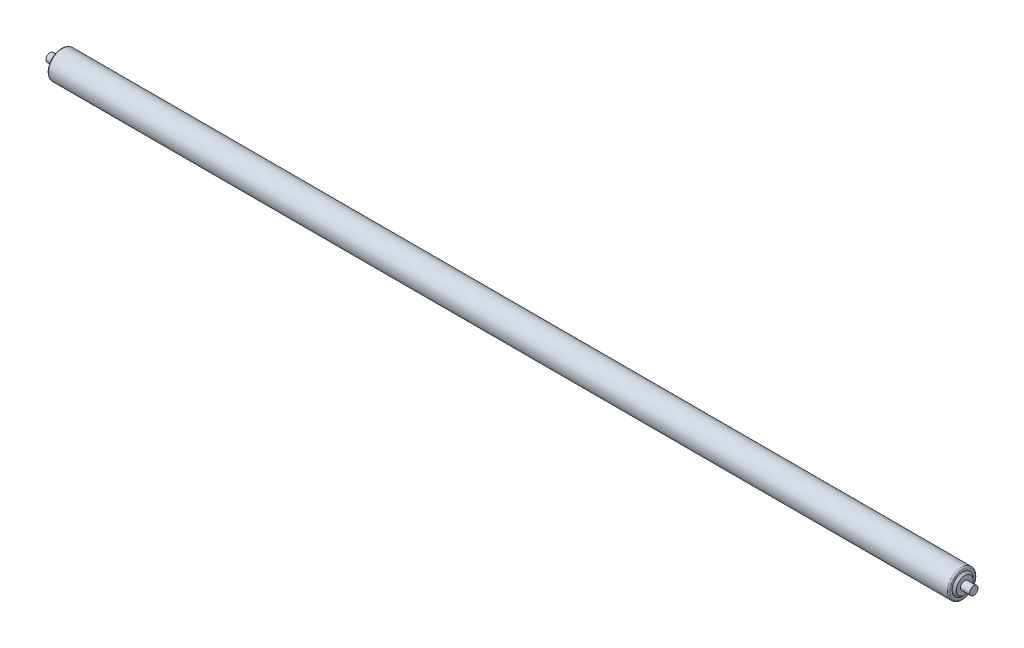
ISO-10303-21;
HEADER;
FILE_DESCRIPTION(('STEP AP214'),'2;1');
FILE_NAME('part.step','',(''),(''),'','','');
FILE_SCHEMA(('AUTOMOTIVE_DESIGN { 1 0 10303 214 1 1 1 1 }'));
ENDSEC;
DATA;
#1=APPLICATION_CONTEXT('core data for automotive mechanical design processes');
#2=APPLICATION_PROTOCOL_DEFINITION('international standard','automotive_design',2000,#1);
#3=PRODUCT_CONTEXT('',#1,'mechanical');
#4=PRODUCT('Part','Part','',(#3));
#5=PRODUCT_RELATED_PRODUCT_CATEGORY('part','',(#4));
#6=PRODUCT_DEFINITION_FORMATION('','',#4);
#7=PRODUCT_DEFINITION_CONTEXT('part definition',#1,'design');
#8=PRODUCT_DEFINITION('design','',#6,#7);
#9=PRODUCT_DEFINITION_SHAPE('','',#8);
#10=(LENGTH_UNIT() NAMED_UNIT(*) SI_UNIT(.MILLI.,.METRE.));
#11=(NAMED_UNIT(*) PLANE_ANGLE_UNIT() SI_UNIT($,.RADIAN.));
#12=(NAMED_UNIT(*) SI_UNIT($,.STERADIAN.) SOLID_ANGLE_UNIT());
#13=UNCERTAINTY_MEASURE_WITH_UNIT(LENGTH_MEASURE(1.E-05),#10,'distance_accuracy_value','');
#14=(GEOMETRIC_REPRESENTATION_CONTEXT(3) GLOBAL_UNCERTAINTY_ASSIGNED_CONTEXT((#13)) GLOBAL_UNIT_ASSIGNED_CONTEXT((#10,
#11,#12)) REPRESENTATION_CONTEXT('',''));
#15=CARTESIAN_POINT('',(0.,0.,0.));
#16=DIRECTION('',(0.,0.,1.));
#17=DIRECTION('',(1.,0.,0.));
#18=AXIS2_PLACEMENT_3D('',#15,#16,#17);
#19=CARTESIAN_POINT('',(324.,6.,0.));
#20=DIRECTION('',(1.,0.,0.));
#21=DIRECTION('',(0.,0.,-1.));
#22=AXIS2_PLACEMENT_3D('',#19,#20,#21);
#23=PLANE('',#22);
#24=CARTESIAN_POINT('',(324.,0.,0.));
#25=DIRECTION('',(1.,0.,0.));
#26=DIRECTION('',(0.,0.,-1.));
#27=AXIS2_PLACEMENT_3D('',#24,#25,#26);
#28=CIRCLE('',#27,6.00000000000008);
#29=CARTESIAN_POINT('',(324.,0.,-6.00000000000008));
#30=VERTEX_POINT('',#29);
#31=EDGE_CURVE('E90',#30,#30,#28,.T.);
#32=ORIENTED_EDGE('',*,*,#31,.T.);
#33=EDGE_LOOP('',(#32));
#34=FACE_BOUND('',#33,.T.);
#35=CARTESIAN_POINT('',(324.,0.,0.));
#36=DIRECTION('',(1.,0.,0.));
#37=DIRECTION('',(0.,0.,-1.));
#38=AXIS2_PLACEMENT_3D('',#35,#36,#37);
#39=CIRCLE('',#38,3.);
#40=CARTESIAN_POINT('',(324.,0.,-3.));
#41=VERTEX_POINT('',#40);
#42=EDGE_CURVE('E10',#41,#41,#39,.T.);
#43=ORIENTED_EDGE('',*,*,#42,.F.);
#44=EDGE_LOOP('',(#43));
#45=FACE_BOUND('',#44,.T.);
#46=ADVANCED_FACE('F38',(#34,#45),#23,.T.);
#47=CARTESIAN_POINT('',(330.5,0.,0.));
#48=DIRECTION('',(1.,0.,0.));
#49=DIRECTION('',(0.,0.,-1.));
#50=AXIS2_PLACEMENT_3D('',#47,#48,#49);
#51=CYLINDRICAL_SURFACE('',#50,3.);
#52=ORIENTED_EDGE('',*,*,#42,.T.);
#53=EDGE_LOOP('',(#52));
#54=FACE_BOUND('',#53,.T.);
#55=CARTESIAN_POINT('',(330.5,0.,0.));
#56=DIRECTION('',(1.,0.,0.));
#57=DIRECTION('',(0.,0.,-1.));
#58=AXIS2_PLACEMENT_3D('',#55,#56,#57);
#59=CIRCLE('',#58,3.);
#60=CARTESIAN_POINT('',(330.5,0.,-3.));
#61=VERTEX_POINT('',#60);
#62=EDGE_CURVE('E45',#61,#61,#59,.T.);
#63=ORIENTED_EDGE('',*,*,#62,.F.);
#64=EDGE_LOOP('',(#63));
#65=FACE_BOUND('',#64,.T.);
#66=ADVANCED_FACE('F108',(#54,#65),#51,.T.);
#67=CARTESIAN_POINT('',(330.5,0.,0.));
#68=DIRECTION('',(1.,0.,0.));
#69=DIRECTION('',(0.,0.,-1.));
#70=AXIS2_PLACEMENT_3D('',#67,#68,#69);
#71=PLANE('',#70);
#72=ORIENTED_EDGE('',*,*,#62,.T.);
#73=EDGE_LOOP('',(#72));
#74=FACE_BOUND('',#73,.T.);
#75=ADVANCED_FACE('F112',(#74),#71,.T.);
#76=CARTESIAN_POINT('',(-330.5,0.,0.));
#77=DIRECTION('',(-1.,0.,0.));
#78=DIRECTION('',(0.,0.,1.));
#79=AXIS2_PLACEMENT_3D('',#76,#77,#78);
#80=PLANE('',#79);
#81=CARTESIAN_POINT('',(-330.5,0.,0.));
#82=DIRECTION('',(1.,0.,0.));
#83=DIRECTION('',(0.,0.,-1.));
#84=AXIS2_PLACEMENT_3D('',#81,#82,#83);
#85=CIRCLE('',#84,3.);
#86=CARTESIAN_POINT('',(-330.5,0.,-3.));
#87=VERTEX_POINT('',#86);
#88=EDGE_CURVE('E52',#87,#87,#85,.T.);
#89=ORIENTED_EDGE('',*,*,#88,.F.);
#90=EDGE_LOOP('',(#89));
#91=FACE_BOUND('',#90,.T.);
#92=ADVANCED_FACE('F116',(#91),#80,.T.);
#93=CARTESIAN_POINT('',(330.5,0.,0.));
#94=DIRECTION('',(1.,0.,0.));
#95=DIRECTION('',(0.,0.,-1.));
#96=AXIS2_PLACEMENT_3D('',#93,#94,#95);
#97=CYLINDRICAL_SURFACE('',#96,3.);
#98=ORIENTED_EDGE('',*,*,#88,.T.);
#99=EDGE_LOOP('',(#98));
#100=FACE_BOUND('',#99,.T.);
#101=CARTESIAN_POINT('',(-325.,0.,0.));
#102=DIRECTION('',(1.,0.,0.));
#103=DIRECTION('',(0.,0.,-1.));
#104=AXIS2_PLACEMENT_3D('',#101,#102,#103);
#105=CIRCLE('',#104,3.);
#106=CARTESIAN_POINT('',(-325.,0.,-3.));
#107=VERTEX_POINT('',#106);
#108=EDGE_CURVE('E58',#107,#107,#105,.T.);
#109=ORIENTED_EDGE('',*,*,#108,.F.);
#110=EDGE_LOOP('',(#109));
#111=FACE_BOUND('',#110,.T.);
#112=ADVANCED_FACE('F122',(#100,#111),#97,.T.);
#113=CARTESIAN_POINT('',(-325.,6.,0.));
#114=DIRECTION('',(-1.,0.,0.));
#115=DIRECTION('',(0.,0.,1.));
#116=AXIS2_PLACEMENT_3D('',#113,#114,#115);
#117=PLANE('',#116);
#118=ORIENTED_EDGE('',*,*,#108,.T.);
#119=EDGE_LOOP('',(#118));
#120=FACE_BOUND('',#119,.T.);
#121=CARTESIAN_POINT('',(-325.,0.,0.));
#122=DIRECTION('',(1.,0.,0.));
#123=DIRECTION('',(0.,0.,-1.));
#124=AXIS2_PLACEMENT_3D('',#121,#122,#123);
#125=CIRCLE('',#124,6.00000000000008);
#126=CARTESIAN_POINT('',(-325.,0.,-6.00000000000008));
#127=VERTEX_POINT('',#126);
#128=EDGE_CURVE('E64',#127,#127,#125,.T.);
#129=ORIENTED_EDGE('',*,*,#128,.F.);
#130=EDGE_LOOP('',(#129));
#131=FACE_BOUND('',#130,.T.);
#132=ADVANCED_FACE('F126',(#120,#131),#117,.T.);
#133=CARTESIAN_POINT('',(-322.5,0.,0.));
#134=DIRECTION('',(1.,0.,0.));
#135=DIRECTION('',(0.,0.,-1.));
#136=AXIS2_PLACEMENT_3D('',#133,#134,#135);
#137=CONICAL_SURFACE('',#136,7.50000000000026,0.540419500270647);
#138=ORIENTED_EDGE('',*,*,#128,.T.);
#139=EDGE_LOOP('',(#138));
#140=FACE_BOUND('',#139,.T.);
#141=CARTESIAN_POINT('',(-322.5,0.,0.));
#142=DIRECTION('',(1.,0.,0.));
#143=DIRECTION('',(0.,0.,-1.));
#144=AXIS2_PLACEMENT_3D('',#141,#142,#143);
#145=CIRCLE('',#144,7.50000000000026);
#146=CARTESIAN_POINT('',(-322.5,0.,-7.50000000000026));
#147=VERTEX_POINT('',#146);
#148=EDGE_CURVE('E68',#147,#147,#145,.T.);
#149=ORIENTED_EDGE('',*,*,#148,.F.);
#150=EDGE_LOOP('',(#149));
#151=FACE_BOUND('',#150,.T.);
#152=ADVANCED_FACE('F130',(#140,#151),#137,.T.);
#153=CARTESIAN_POINT('',(-322.5,7.50000000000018,0.));
#154=DIRECTION('',(-1.,0.,0.));
#155=DIRECTION('',(0.,0.,1.));
#156=AXIS2_PLACEMENT_3D('',#153,#154,#155);
#157=PLANE('',#156);
#158=ORIENTED_EDGE('',*,*,#148,.T.);
#159=EDGE_LOOP('',(#158));
#160=FACE_BOUND('',#159,.T.);
#161=CARTESIAN_POINT('',(-322.5,0.,0.));
#162=DIRECTION('',(1.,0.,0.));
#163=DIRECTION('',(0.,0.,-1.));
#164=AXIS2_PLACEMENT_3D('',#161,#162,#163);
#165=CIRCLE('',#164,8.99999999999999);
#166=CARTESIAN_POINT('',(-322.5,0.,-8.99999999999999));
#167=VERTEX_POINT('',#166);
#168=EDGE_CURVE('E71',#167,#167,#165,.T.);
#169=ORIENTED_EDGE('',*,*,#168,.F.);
#170=EDGE_LOOP('',(#169));
#171=FACE_BOUND('',#170,.T.);
#172=ADVANCED_FACE('F134',(#160,#171),#157,.T.);
#173=CARTESIAN_POINT('',(-321.5,0.,0.));
#174=DIRECTION('',(1.,0.,0.));
#175=DIRECTION('',(0.,0.,-1.));
#176=AXIS2_PLACEMENT_3D('',#173,#174,#175);
#177=TOROIDAL_SURFACE('',#176,9.,1.);
#178=ORIENTED_EDGE('',*,*,#168,.T.);
#179=EDGE_LOOP('',(#178));
#180=FACE_BOUND('',#179,.T.);
#181=CARTESIAN_POINT('',(-321.5,0.,0.));
#182=DIRECTION('',(1.,0.,0.));
#183=DIRECTION('',(0.,0.,-1.));
#184=AXIS2_PLACEMENT_3D('',#181,#182,#183);
#185=CIRCLE('',#184,10.);
#186=CARTESIAN_POINT('',(-321.5,0.,-10.));
#187=VERTEX_POINT('',#186);
#188=EDGE_CURVE('E75',#187,#187,#185,.T.);
#189=ORIENTED_EDGE('',*,*,#188,.F.);
#190=EDGE_LOOP('',(#189));
#191=FACE_BOUND('',#190,.T.);
#192=ADVANCED_FACE('F138',(#180,#191),#177,.T.);
#193=CARTESIAN_POINT('',(330.5,0.,0.));
#194=DIRECTION('',(1.,0.,0.));
#195=DIRECTION('',(0.,0.,-1.));
#196=AXIS2_PLACEMENT_3D('',#193,#194,#195);
#197=CYLINDRICAL_SURFACE('',#196,10.);
#198=ORIENTED_EDGE('',*,*,#188,.T.);
#199=EDGE_LOOP('',(#198));
#200=FACE_BOUND('',#199,.T.);
#201=CARTESIAN_POINT('',(321.5,0.,0.));
#202=DIRECTION('',(1.,0.,0.));
#203=DIRECTION('',(0.,0.,-1.));
#204=AXIS2_PLACEMENT_3D('',#201,#202,#203);
#205=CIRCLE('',#204,10.);
#206=CARTESIAN_POINT('',(321.5,0.,-10.));
#207=VERTEX_POINT('',#206);
#208=EDGE_CURVE('E79',#207,#207,#205,.T.);
#209=ORIENTED_EDGE('',*,*,#208,.F.);
#210=EDGE_LOOP('',(#209));
#211=FACE_BOUND('',#210,.T.);
#212=ADVANCED_FACE('F142',(#200,#211),#197,.T.);
#213=CARTESIAN_POINT('',(321.5,0.,0.));
#214=DIRECTION('',(1.,0.,0.));
#215=DIRECTION('',(0.,0.,-1.));
#216=AXIS2_PLACEMENT_3D('',#213,#214,#215);
#217=TOROIDAL_SURFACE('',#216,9.,1.);
#218=ORIENTED_EDGE('',*,*,#208,.T.);
#219=EDGE_LOOP('',(#218));
#220=FACE_BOUND('',#219,.T.);
#221=CARTESIAN_POINT('',(322.5,0.,0.));
#222=DIRECTION('',(1.,0.,0.));
#223=DIRECTION('',(0.,0.,-1.));
#224=AXIS2_PLACEMENT_3D('',#221,#222,#223);
#225=CIRCLE('',#224,8.99999999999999);
#226=CARTESIAN_POINT('',(322.5,0.,-8.99999999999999));
#227=VERTEX_POINT('',#226);
#228=EDGE_CURVE('E83',#227,#227,#225,.T.);
#229=ORIENTED_EDGE('',*,*,#228,.F.);
#230=EDGE_LOOP('',(#229));
#231=FACE_BOUND('',#230,.T.);
#232=ADVANCED_FACE('F104',(#220,#231),#217,.T.);
#233=CARTESIAN_POINT('',(322.5,7.50000000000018,0.));
#234=DIRECTION('',(1.,0.,0.));
#235=DIRECTION('',(0.,0.,-1.));
#236=AXIS2_PLACEMENT_3D('',#233,#234,#235);
#237=PLANE('',#236);
#238=ORIENTED_EDGE('',*,*,#228,.T.);
#239=EDGE_LOOP('',(#238));
#240=FACE_BOUND('',#239,.T.);
#241=CARTESIAN_POINT('',(322.5,0.,0.));
#242=DIRECTION('',(1.,0.,0.));
#243=DIRECTION('',(0.,0.,-1.));
#244=AXIS2_PLACEMENT_3D('',#241,#242,#243);
#245=CIRCLE('',#244,7.50000000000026);
#246=CARTESIAN_POINT('',(322.5,0.,-7.50000000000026));
#247=VERTEX_POINT('',#246);
#248=EDGE_CURVE('E87',#247,#247,#245,.T.);
#249=ORIENTED_EDGE('',*,*,#248,.F.);
#250=EDGE_LOOP('',(#249));
#251=FACE_BOUND('',#250,.T.);
#252=ADVANCED_FACE('F98',(#240,#251),#237,.T.);
#253=CARTESIAN_POINT('',(324.,0.,0.));
#254=DIRECTION('',(-1.,0.,0.));
#255=DIRECTION('',(0.,0.,1.));
#256=AXIS2_PLACEMENT_3D('',#253,#254,#255);
#257=CONICAL_SURFACE('',#256,6.00000000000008,0.785398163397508);
#258=ORIENTED_EDGE('',*,*,#248,.T.);
#259=EDGE_LOOP('',(#258));
#260=FACE_BOUND('',#259,.T.);
#261=ORIENTED_EDGE('',*,*,#31,.F.);
#262=EDGE_LOOP('',(#261));
#263=FACE_BOUND('',#262,.T.);
#264=ADVANCED_FACE('F96',(#260,#263),#257,.T.);
#265=CLOSED_SHELL('',(#46,#66,#75,#92,#112,#132,#152,#172,#192,#212,#232,#252,#264));
#266=MANIFOLD_SOLID_BREP('B2',#265);
#267=ADVANCED_BREP_SHAPE_REPRESENTATION('',(#18,#266),#14);
#268=SHAPE_DEFINITION_REPRESENTATION(#9,#267);
ENDSEC;
END-ISO-10303-21;
